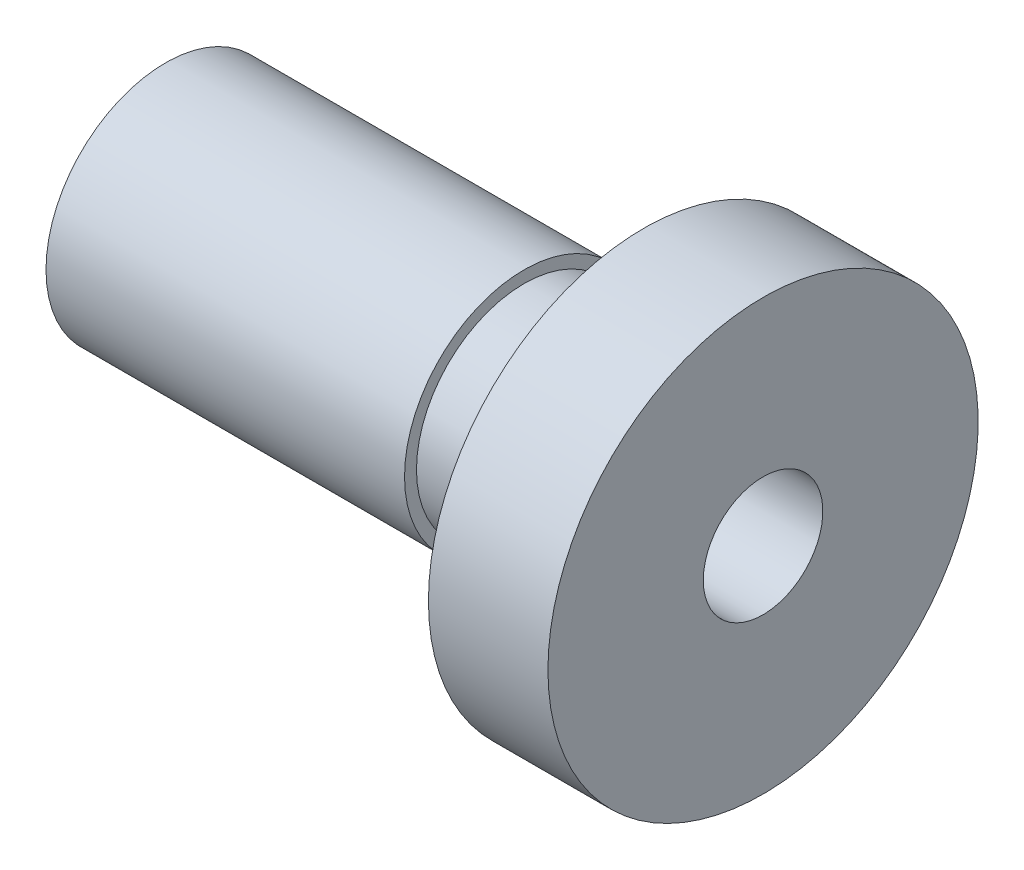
from build123d import *


with BuildPart() as part:
    # Esquisse1 → R_volution1 (revolve)
    with BuildSketch(Plane.XY, mode=Mode.PRIVATE) as r_volution1_sk:
        Polygon((0, 5), (50, 5), (50, 18), (40, 18), (40, 9), (30, 9), (30, 10), (0, 10), align=None)
    revolve(r_volution1_sk.sketch.rotate(Axis((0, 0, 0), (1, 0, 0)), 90), axis=Axis((0, 0, 0), (1, 0, 0)))


solid = part.part
